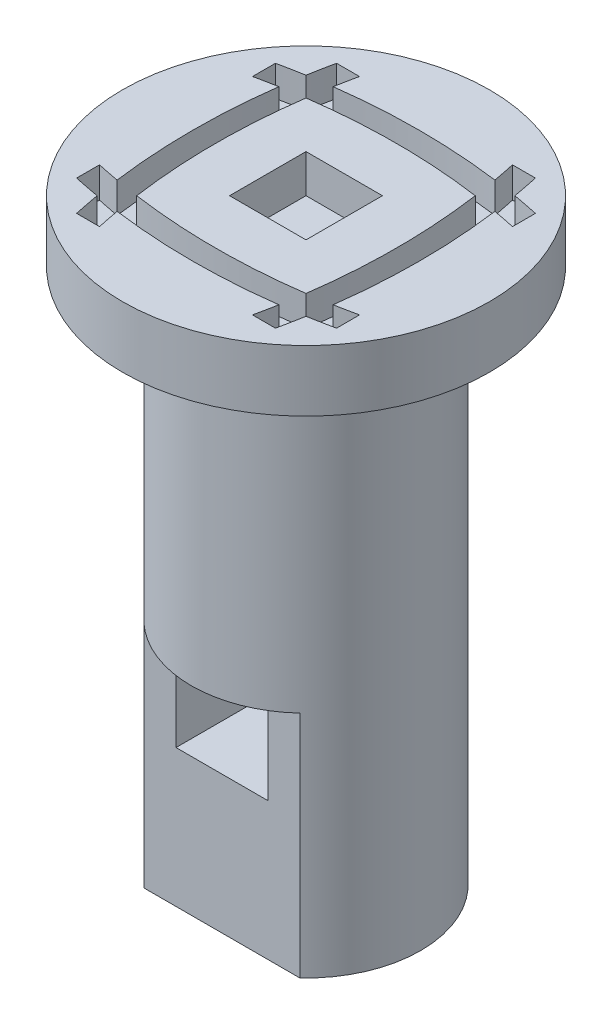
from build123d import *

# Parameters (mm, degrees)
SKETCH1_R           = 24
BOSS_EXTRUDE1_DEPTH = 8
SKETCH3_W           = 10
SKETCH3_H           = 10
CUT_EXTRUDE2_DEPTH  = 5
SKETCH8_R           = 15
BOSS_EXTRUDE3_DEPTH = 70
CUT_EXTRUDE4_START  = -30
CUT_EXTRUDE4_DEPTH  = 30
SKETCH10_W          = 12
SKETCH10_H          = 12
CUT_EXTRUDE5_DEPTH  = 12
CUT_EXTRUDE6_DEPTH  = 4


with BuildPart() as part:
    # Sketch1 → Boss-Extrude1 (new body)
    with BuildSketch(Plane(origin=(0, 0, 0), x_dir=(1, 0, 0), z_dir=(0, 1, 0))):
        with Locations(Location((0, 0, 0), (0, 0, 270))):
            Circle(SKETCH1_R)
    extrude(amount=BOSS_EXTRUDE1_DEPTH)

    # Sketch3 → Cut-Extrude2 (cut)
    with BuildSketch(Plane(origin=(0, 8, 0), x_dir=(1, 0, 0), z_dir=(0, 1, 0))):
        Rectangle(SKETCH3_W, SKETCH3_H)
    extrude(amount=-CUT_EXTRUDE2_DEPTH, mode=Mode.SUBTRACT)

    # Sketch8 → Boss-Extrude3 (add)
    with BuildSketch(Plane.XZ):
        with Locations(Location((0, 0, 0), (0, 0, 90))):
            Circle(SKETCH8_R)
    extrude(amount=BOSS_EXTRUDE3_DEPTH)

    # Sketch9 → Cut-Extrude4 (cut)
    with BuildSketch(Plane.XZ.offset(70).offset(CUT_EXTRUDE4_START)):
        with BuildLine():
            Line((-10.198039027, 11), (10.198039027, 11))
            ThreePointArc((10.198039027, 11), (0, 15), (-10.198039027, 11))
        make_face()
    extrude(amount=CUT_EXTRUDE4_DEPTH, mode=Mode.SUBTRACT)

    # Sketch10 → Cut-Extrude5 (cut)
    with BuildSketch(Plane.XY.offset(11)):
        with Locations((0, -46)):
            Rectangle(SKETCH10_W, SKETCH10_H)
    extrude(amount=-CUT_EXTRUDE5_DEPTH, mode=Mode.SUBTRACT)

    # Sketch11 → Cut-Extrude6 (cut)
    with BuildSketch(Plane(origin=(0, 8, 0), x_dir=(1, 0, 0), z_dir=(0, 1, 0))):
        with BuildLine():
            Line((10, 17), (13, 17))
            ThreePointArc((13, 17), (13.344535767, 15.330185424), (13.653407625, 13.653407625))
            ThreePointArc((13.653407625, 13.653407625), (15.330185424, 13.344535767), (17, 13))
            Line((17, 13), (17, 10))
            ThreePointArc((17, 10), (15.565150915, 10.301241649), (14.124974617, 10.575888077))
            ThreePointArc((14.124974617, 10.575888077), (14.827114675, 0), (14.124974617, -10.575888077))
            ThreePointArc((14.124974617, -10.575888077), (15.565150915, -10.301241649), (17, -10))
            Line((17, -10), (17, -13))
            ThreePointArc((17, -13), (15.330185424, -13.344535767), (13.653407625, -13.653407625))
            ThreePointArc((13.653407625, -13.653407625), (13.344535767, -15.330185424), (13, -17))
            Line((13, -17), (10, -17))
            ThreePointArc((10, -17), (10.301241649, -15.565150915), (10.575888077, -14.124974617))
            ThreePointArc((10.575888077, -14.124974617), (0, -14.827114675), (-10.575888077, -14.124974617))
            ThreePointArc((-10.575888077, -14.124974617), (-10.301241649, -15.565150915), (-10, -17))
            Line((-10, -17), (-13, -17))
            ThreePointArc((-13, -17), (-13.344535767, -15.330185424), (-13.653407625, -13.653407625))
            ThreePointArc((-13.653407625, -13.653407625), (-15.330185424, -13.344535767), (-17, -13))
            Line((-17, -13), (-17, -10))
            ThreePointArc((-17, -10), (-15.565150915, -10.301241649), (-14.124974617, -10.575888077))
            ThreePointArc((-14.124974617, -10.575888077), (-14.827114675, 0), (-14.124974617, 10.575888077))
            ThreePointArc((-14.124974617, 10.575888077), (-15.565150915, 10.301241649), (-17, 10))
            Line((-17, 10), (-17, 13))
            ThreePointArc((-17, 13), (-15.330185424, 13.344535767), (-13.653407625, 13.653407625))
            ThreePointArc((-13.653407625, 13.653407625), (-13.344535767, 15.330185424), (-13, 17))
            Line((-13, 17), (-10, 17))
            ThreePointArc((-10, 17), (-10.301241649, 15.565150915), (-10.575888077, 14.124974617))
            ThreePointArc((-10.575888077, 14.124974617), (0, 14.827114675), (10.575888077, 14.124974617))
            ThreePointArc((10.575888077, 14.124974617), (10.301241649, 15.565150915), (10, 17))
        make_face()
        with BuildLine():
            ThreePointArc((-11.068118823, 11.068118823), (0, 11.844816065), (11.068118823, 11.068118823))
            ThreePointArc((11.068118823, 11.068118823), (11.844816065, 0), (11.068118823, -11.068118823))
            ThreePointArc((11.068118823, -11.068118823), (0, -11.844816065), (-11.068118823, -11.068118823))
            ThreePointArc((-11.068118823, -11.068118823), (-11.844816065, 0), (-11.068118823, 11.068118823))
        make_face(mode=Mode.SUBTRACT)
    extrude(amount=-CUT_EXTRUDE6_DEPTH, mode=Mode.SUBTRACT)


solid = part.part
